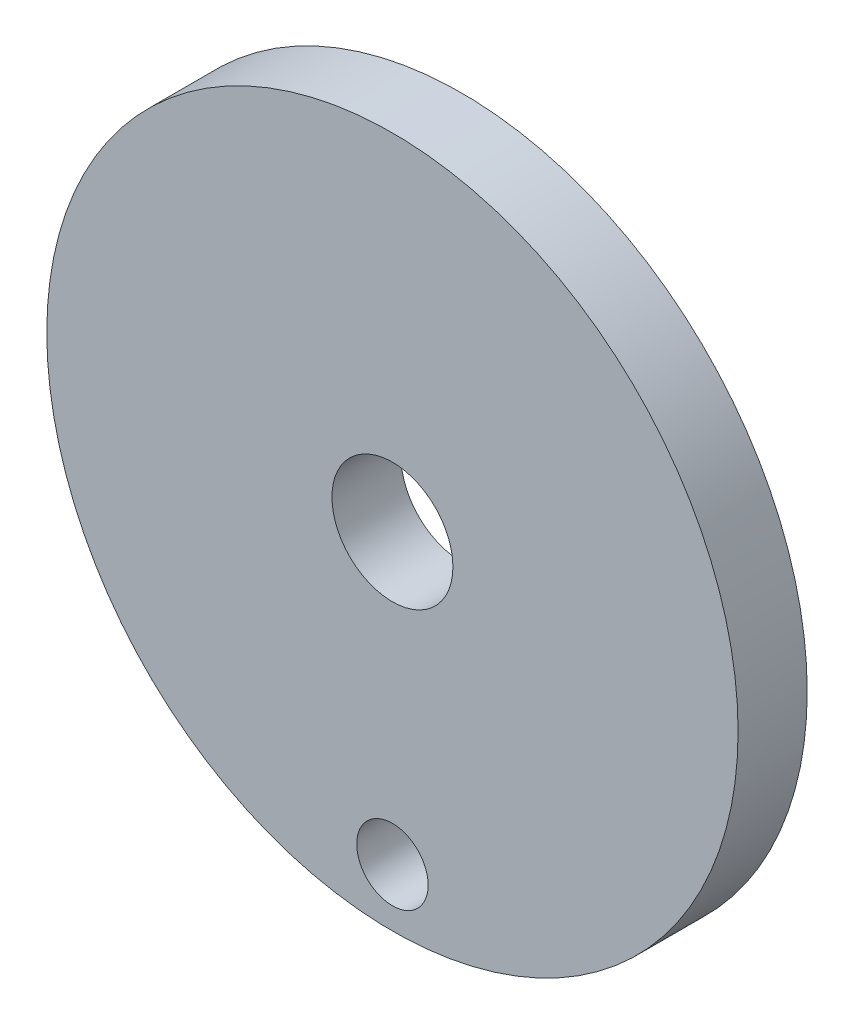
ISO-10303-21;
HEADER;
FILE_DESCRIPTION(('STEP AP214'),'2;1');
FILE_NAME('part.step','',(''),(''),'','','');
FILE_SCHEMA(('AUTOMOTIVE_DESIGN { 1 0 10303 214 1 1 1 1 }'));
ENDSEC;
DATA;
#1=APPLICATION_CONTEXT('core data for automotive mechanical design processes');
#2=APPLICATION_PROTOCOL_DEFINITION('international standard','automotive_design',2000,#1);
#3=PRODUCT_CONTEXT('',#1,'mechanical');
#4=PRODUCT('Part','Part','',(#3));
#5=PRODUCT_RELATED_PRODUCT_CATEGORY('part','',(#4));
#6=PRODUCT_DEFINITION_FORMATION('','',#4);
#7=PRODUCT_DEFINITION_CONTEXT('part definition',#1,'design');
#8=PRODUCT_DEFINITION('design','',#6,#7);
#9=PRODUCT_DEFINITION_SHAPE('','',#8);
#10=(LENGTH_UNIT() NAMED_UNIT(*) SI_UNIT(.MILLI.,.METRE.));
#11=(NAMED_UNIT(*) PLANE_ANGLE_UNIT() SI_UNIT($,.RADIAN.));
#12=(NAMED_UNIT(*) SI_UNIT($,.STERADIAN.) SOLID_ANGLE_UNIT());
#13=UNCERTAINTY_MEASURE_WITH_UNIT(LENGTH_MEASURE(1.E-05),#10,'distance_accuracy_value','');
#14=(GEOMETRIC_REPRESENTATION_CONTEXT(3) GLOBAL_UNCERTAINTY_ASSIGNED_CONTEXT((#13)) GLOBAL_UNIT_ASSIGNED_CONTEXT((#10,
#11,#12)) REPRESENTATION_CONTEXT('',''));
#15=CARTESIAN_POINT('',(0.,0.,0.));
#16=DIRECTION('',(0.,0.,1.));
#17=DIRECTION('',(1.,0.,0.));
#18=AXIS2_PLACEMENT_3D('',#15,#16,#17);
#19=CARTESIAN_POINT('',(0.,0.,6.));
#20=DIRECTION('',(0.,0.,1.));
#21=DIRECTION('',(1.,0.,0.));
#22=AXIS2_PLACEMENT_3D('',#19,#20,#21);
#23=PLANE('',#22);
#24=CARTESIAN_POINT('',(0.,0.,6.));
#25=DIRECTION('',(0.,0.,1.));
#26=DIRECTION('',(1.,0.,0.));
#27=AXIS2_PLACEMENT_3D('',#24,#25,#26);
#28=CIRCLE('',#27,5.25);
#29=CARTESIAN_POINT('',(5.25,0.,6.));
#30=VERTEX_POINT('',#29);
#31=EDGE_CURVE('E35',#30,#30,#28,.T.);
#32=ORIENTED_EDGE('',*,*,#31,.F.);
#33=EDGE_LOOP('',(#32));
#34=FACE_BOUND('',#33,.T.);
#35=CARTESIAN_POINT('',(0.,0.,6.));
#36=DIRECTION('',(0.,0.,1.));
#37=DIRECTION('',(1.,0.,0.));
#38=AXIS2_PLACEMENT_3D('',#35,#36,#37);
#39=CIRCLE('',#38,30.);
#40=CARTESIAN_POINT('',(30.,0.,6.));
#41=VERTEX_POINT('',#40);
#42=EDGE_CURVE('E10',#41,#41,#39,.T.);
#43=ORIENTED_EDGE('',*,*,#42,.T.);
#44=EDGE_LOOP('',(#43));
#45=FACE_BOUND('',#44,.T.);
#46=CARTESIAN_POINT('',(0.,-25.,6.));
#47=DIRECTION('',(0.,0.,1.));
#48=DIRECTION('',(1.,0.,0.));
#49=AXIS2_PLACEMENT_3D('',#46,#47,#48);
#50=CIRCLE('',#49,3.1);
#51=CARTESIAN_POINT('',(3.1,-25.,6.));
#52=VERTEX_POINT('',#51);
#53=EDGE_CURVE('E44',#52,#52,#50,.T.);
#54=ORIENTED_EDGE('',*,*,#53,.F.);
#55=EDGE_LOOP('',(#54));
#56=FACE_BOUND('',#55,.T.);
#57=ADVANCED_FACE('F24',(#34,#45,#56),#23,.T.);
#58=CARTESIAN_POINT('',(0.,0.,0.));
#59=DIRECTION('',(0.,0.,1.));
#60=DIRECTION('',(1.,0.,0.));
#61=AXIS2_PLACEMENT_3D('',#58,#59,#60);
#62=PLANE('',#61);
#63=CARTESIAN_POINT('',(0.,0.,0.));
#64=DIRECTION('',(0.,0.,1.));
#65=DIRECTION('',(1.,0.,0.));
#66=AXIS2_PLACEMENT_3D('',#63,#64,#65);
#67=CIRCLE('',#66,5.25);
#68=CARTESIAN_POINT('',(5.25,0.,0.));
#69=VERTEX_POINT('',#68);
#70=EDGE_CURVE('E39',#69,#69,#67,.T.);
#71=ORIENTED_EDGE('',*,*,#70,.T.);
#72=EDGE_LOOP('',(#71));
#73=FACE_BOUND('',#72,.T.);
#74=CARTESIAN_POINT('',(0.,0.,0.));
#75=DIRECTION('',(0.,0.,1.));
#76=DIRECTION('',(1.,0.,0.));
#77=AXIS2_PLACEMENT_3D('',#74,#75,#76);
#78=CIRCLE('',#77,30.);
#79=CARTESIAN_POINT('',(30.,0.,0.));
#80=VERTEX_POINT('',#79);
#81=EDGE_CURVE('E31',#80,#80,#78,.T.);
#82=ORIENTED_EDGE('',*,*,#81,.F.);
#83=EDGE_LOOP('',(#82));
#84=FACE_BOUND('',#83,.T.);
#85=CARTESIAN_POINT('',(0.,-25.,0.));
#86=DIRECTION('',(0.,0.,1.));
#87=DIRECTION('',(1.,0.,0.));
#88=AXIS2_PLACEMENT_3D('',#85,#86,#87);
#89=CIRCLE('',#88,3.1);
#90=CARTESIAN_POINT('',(3.1,-25.,0.));
#91=VERTEX_POINT('',#90);
#92=EDGE_CURVE('E47',#91,#91,#89,.T.);
#93=ORIENTED_EDGE('',*,*,#92,.T.);
#94=EDGE_LOOP('',(#93));
#95=FACE_BOUND('',#94,.T.);
#96=ADVANCED_FACE('F51',(#73,#84,#95),#62,.F.);
#97=CARTESIAN_POINT('',(0.,0.,6.));
#98=DIRECTION('',(0.,0.,-1.));
#99=DIRECTION('',(-1.,0.,0.));
#100=AXIS2_PLACEMENT_3D('',#97,#98,#99);
#101=CYLINDRICAL_SURFACE('',#100,30.);
#102=ORIENTED_EDGE('',*,*,#42,.F.);
#103=EDGE_LOOP('',(#102));
#104=FACE_BOUND('',#103,.T.);
#105=ORIENTED_EDGE('',*,*,#81,.T.);
#106=EDGE_LOOP('',(#105));
#107=FACE_BOUND('',#106,.T.);
#108=ADVANCED_FACE('F26',(#104,#107),#101,.T.);
#109=CARTESIAN_POINT('',(0.,0.,6.));
#110=DIRECTION('',(0.,0.,-1.));
#111=DIRECTION('',(-1.,0.,0.));
#112=AXIS2_PLACEMENT_3D('',#109,#110,#111);
#113=CYLINDRICAL_SURFACE('',#112,5.25);
#114=ORIENTED_EDGE('',*,*,#31,.T.);
#115=EDGE_LOOP('',(#114));
#116=FACE_BOUND('',#115,.T.);
#117=ORIENTED_EDGE('',*,*,#70,.F.);
#118=EDGE_LOOP('',(#117));
#119=FACE_BOUND('',#118,.T.);
#120=ADVANCED_FACE('F55',(#116,#119),#113,.F.);
#121=CARTESIAN_POINT('',(0.,-25.,6.));
#122=DIRECTION('',(0.,0.,-1.));
#123=DIRECTION('',(-1.,0.,0.));
#124=AXIS2_PLACEMENT_3D('',#121,#122,#123);
#125=CYLINDRICAL_SURFACE('',#124,3.1);
#126=ORIENTED_EDGE('',*,*,#53,.T.);
#127=EDGE_LOOP('',(#126));
#128=FACE_BOUND('',#127,.T.);
#129=ORIENTED_EDGE('',*,*,#92,.F.);
#130=EDGE_LOOP('',(#129));
#131=FACE_BOUND('',#130,.T.);
#132=ADVANCED_FACE('F53',(#128,#131),#125,.F.);
#133=CLOSED_SHELL('',(#57,#96,#108,#120,#132));
#134=MANIFOLD_SOLID_BREP('B2',#133);
#135=ADVANCED_BREP_SHAPE_REPRESENTATION('',(#18,#134),#14);
#136=SHAPE_DEFINITION_REPRESENTATION(#9,#135);
ENDSEC;
END-ISO-10303-21;
